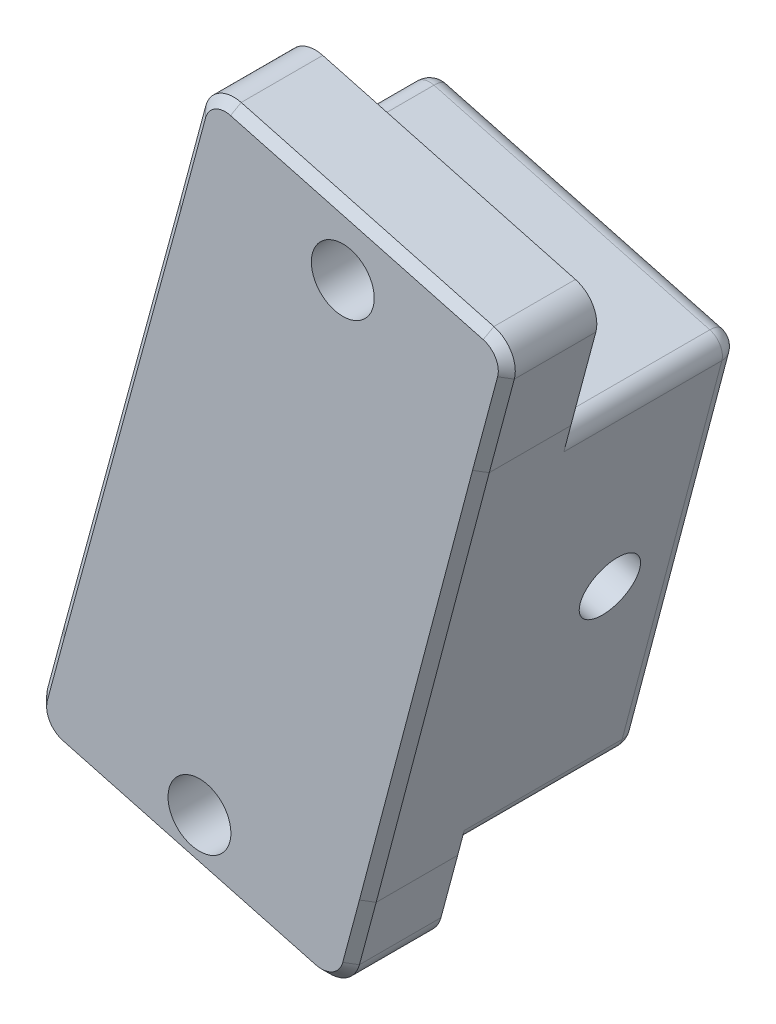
ISO-10303-21;
HEADER;
FILE_DESCRIPTION(('STEP AP214'),'2;1');
FILE_NAME('part.step','',(''),(''),'','','');
FILE_SCHEMA(('AUTOMOTIVE_DESIGN { 1 0 10303 214 1 1 1 1 }'));
ENDSEC;
DATA;
#1=APPLICATION_CONTEXT('core data for automotive mechanical design processes');
#2=APPLICATION_PROTOCOL_DEFINITION('international standard','automotive_design',2000,#1);
#3=PRODUCT_CONTEXT('',#1,'mechanical');
#4=PRODUCT('Part','Part','',(#3));
#5=PRODUCT_RELATED_PRODUCT_CATEGORY('part','',(#4));
#6=PRODUCT_DEFINITION_FORMATION('','',#4);
#7=PRODUCT_DEFINITION_CONTEXT('part definition',#1,'design');
#8=PRODUCT_DEFINITION('design','',#6,#7);
#9=PRODUCT_DEFINITION_SHAPE('','',#8);
#10=(LENGTH_UNIT() NAMED_UNIT(*) SI_UNIT(.MILLI.,.METRE.));
#11=(NAMED_UNIT(*) PLANE_ANGLE_UNIT() SI_UNIT($,.RADIAN.));
#12=(NAMED_UNIT(*) SI_UNIT($,.STERADIAN.) SOLID_ANGLE_UNIT());
#13=UNCERTAINTY_MEASURE_WITH_UNIT(LENGTH_MEASURE(1.E-05),#10,'distance_accuracy_value','');
#14=(GEOMETRIC_REPRESENTATION_CONTEXT(3) GLOBAL_UNCERTAINTY_ASSIGNED_CONTEXT((#13)) GLOBAL_UNIT_ASSIGNED_CONTEXT((#10,
#11,#12)) REPRESENTATION_CONTEXT('',''));
#15=CARTESIAN_POINT('',(0.,0.,0.));
#16=DIRECTION('',(0.,0.,1.));
#17=DIRECTION('',(1.,0.,0.));
#18=AXIS2_PLACEMENT_3D('',#15,#16,#17);
#19=CARTESIAN_POINT('',(63.1718953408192,-38.5433302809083,0.));
#20=DIRECTION('',(0.,0.,1.));
#21=DIRECTION('',(1.,0.,0.));
#22=AXIS2_PLACEMENT_3D('',#19,#20,#21);
#23=PLANE('',#22);
#24=CARTESIAN_POINT('',(59.1942618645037,-38.5128027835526,0.));
#25=DIRECTION('',(0.,0.,1.));
#26=DIRECTION('',(1.,0.,0.));
#27=AXIS2_PLACEMENT_3D('',#24,#25,#26);
#28=CIRCLE('',#27,0.925000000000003);
#29=CARTESIAN_POINT('',(60.1192618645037,-38.5128027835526,0.));
#30=VERTEX_POINT('',#29);
#31=EDGE_CURVE('E258',#30,#30,#28,.T.);
#32=ORIENTED_EDGE('',*,*,#31,.T.);
#33=EDGE_LOOP('',(#32));
#34=FACE_BOUND('',#33,.T.);
#35=DIRECTION('',(0.965925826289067,-0.258819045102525,0.));
#36=VECTOR('',#35,1.);
#37=CARTESIAN_POINT('',(63.1787625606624,-41.8062903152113,0.));
#38=LINE('',#37,#36);
#39=CARTESIAN_POINT('',(54.5779552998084,-39.5017109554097,0.));
#40=VERTEX_POINT('',#39);
#41=CARTESIAN_POINT('',(62.6976465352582,-41.6773756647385,0.));
#42=VERTEX_POINT('',#41);
#43=EDGE_CURVE('E312',#40,#42,#38,.T.);
#44=ORIENTED_EDGE('',*,*,#43,.F.);
#45=CARTESIAN_POINT('',(54.4485457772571,-39.9846738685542,0.));
#46=DIRECTION('',(0.,0.,1.));
#47=DIRECTION('',(1.,0.,0.));
#48=AXIS2_PLACEMENT_3D('',#45,#46,#47);
#49=CIRCLE('',#48,0.5);
#50=CARTESIAN_POINT('',(53.9660822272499,-39.8534148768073,0.));
#51=VERTEX_POINT('',#50);
#52=EDGE_CURVE('E431',#40,#51,#49,.T.);
#53=ORIENTED_EDGE('',*,*,#52,.T.);
#54=DIRECTION('',(-0.262517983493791,-0.96492710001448,0.));
#55=VECTOR('',#54,1.);
#56=CARTESIAN_POINT('',(50.749710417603,-51.6757071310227,0.));
#57=LINE('',#56,#55);
#58=CARTESIAN_POINT('',(54.1755952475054,-39.0833160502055,0.));
#59=VERTEX_POINT('',#58);
#60=EDGE_CURVE('E267',#59,#51,#57,.T.);
#61=ORIENTED_EDGE('',*,*,#60,.F.);
#62=DIRECTION('',(-0.258819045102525,-0.965925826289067,0.));
#63=VECTOR('',#62,1.);
#64=CARTESIAN_POINT('',(54.9132295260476,-36.3304274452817,0.));
#65=LINE('',#64,#63);
#66=CARTESIAN_POINT('',(54.9132295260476,-36.3304274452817,0.));
#67=VERTEX_POINT('',#66);
#68=EDGE_CURVE('E263',#67,#59,#65,.T.);
#69=ORIENTED_EDGE('',*,*,#68,.F.);
#70=CARTESIAN_POINT('',(55.7342664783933,-36.5504236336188,0.));
#71=DIRECTION('',(0.,0.,1.));
#72=DIRECTION('',(1.,0.,0.));
#73=AXIS2_PLACEMENT_3D('',#70,#71,#72);
#74=CIRCLE('',#73,0.85);
#75=CARTESIAN_POINT('',(55.9542626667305,-35.7293866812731,0.));
#76=VERTEX_POINT('',#75);
#77=EDGE_CURVE('E249',#76,#67,#74,.T.);
#78=ORIENTED_EDGE('',*,*,#77,.F.);
#79=DIRECTION('',(-0.965925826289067,0.258819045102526,0.));
#80=VECTOR('',#79,1.);
#81=CARTESIAN_POINT('',(63.3918915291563,-37.7222933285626,0.));
#82=LINE('',#81,#80);
#83=CARTESIAN_POINT('',(63.3918915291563,-37.7222933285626,0.));
#84=VERTEX_POINT('',#83);
#85=EDGE_CURVE('E234',#84,#76,#82,.T.);
#86=ORIENTED_EDGE('',*,*,#85,.F.);
#87=CARTESIAN_POINT('',(63.1718953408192,-38.5433302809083,0.));
#88=DIRECTION('',(0.,0.,1.));
#89=DIRECTION('',(1.,0.,0.));
#90=AXIS2_PLACEMENT_3D('',#87,#88,#89);
#91=CIRCLE('',#90,0.850000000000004);
#92=CARTESIAN_POINT('',(63.9929322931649,-38.7633264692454,0.));
#93=VERTEX_POINT('',#92);
#94=EDGE_CURVE('E246',#93,#84,#91,.T.);
#95=ORIENTED_EDGE('',*,*,#94,.F.);
#96=DIRECTION('',(0.258819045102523,0.965925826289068,0.));
#97=VECTOR('',#96,1.);
#98=CARTESIAN_POINT('',(63.2552980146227,-41.5162150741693,0.));
#99=LINE('',#98,#97);
#100=CARTESIAN_POINT('',(63.2552980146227,-41.5162150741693,0.));
#101=VERTEX_POINT('',#100);
#102=EDGE_CURVE('E286',#101,#93,#99,.T.);
#103=ORIENTED_EDGE('',*,*,#102,.F.);
#104=DIRECTION('',(0.255116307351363,0.96691037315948,0.));
#105=VECTOR('',#104,1.);
#106=CARTESIAN_POINT('',(63.2552980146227,-41.5162150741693,0.));
#107=LINE('',#106,#105);
#108=CARTESIAN_POINT('',(63.0516921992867,-42.2878967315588,0.));
#109=VERTEX_POINT('',#108);
#110=EDGE_CURVE('E60',#109,#101,#107,.T.);
#111=ORIENTED_EDGE('',*,*,#110,.F.);
#112=CARTESIAN_POINT('',(62.5682370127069,-42.1603385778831,0.));
#113=DIRECTION('',(0.,0.,1.));
#114=DIRECTION('',(1.,0.,0.));
#115=AXIS2_PLACEMENT_3D('',#112,#113,#114);
#116=CIRCLE('',#115,0.5);
#117=EDGE_CURVE('E434',#109,#42,#116,.T.);
#118=ORIENTED_EDGE('',*,*,#117,.T.);
#119=EDGE_LOOP('',(#44,#53,#61,#69,#78,#86,#95,#103,#111,#118));
#120=FACE_BOUND('',#119,.T.);
#121=ADVANCED_FACE('F43',(#34,#120),#23,.F.);
#122=CARTESIAN_POINT('',(54.9755114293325,-54.2573937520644,0.));
#123=DIRECTION('',(0.,0.,1.));
#124=DIRECTION('',(1.,0.,0.));
#125=AXIS2_PLACEMENT_3D('',#122,#123,#124);
#126=CIRCLE('',#125,0.925000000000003);
#127=CARTESIAN_POINT('',(55.9005114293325,-54.2573937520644,0.));
#128=VERTEX_POINT('',#127);
#129=EDGE_CURVE('E255',#128,#128,#126,.T.);
#130=ORIENTED_EDGE('',*,*,#129,.T.);
#131=EDGE_LOOP('',(#130));
#132=FACE_BOUND('',#131,.T.);
#133=DIRECTION('',(-0.965925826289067,0.258819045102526,0.));
#134=VECTOR('',#133,1.);
#135=CARTESIAN_POINT('',(59.9897853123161,-53.8927586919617,0.));
#136=LINE('',#135,#134);
#137=CARTESIAN_POINT('',(59.5049684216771,-53.762852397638,0.));
#138=VERTEX_POINT('',#137);
#139=CARTESIAN_POINT('',(51.3001572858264,-51.5643798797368,0.));
#140=VERTEX_POINT('',#139);
#141=EDGE_CURVE('E397',#138,#140,#136,.T.);
#142=ORIENTED_EDGE('',*,*,#141,.F.);
#143=CARTESIAN_POINT('',(59.6343779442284,-53.2798894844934,0.));
#144=DIRECTION('',(0.,0.,1.));
#145=DIRECTION('',(1.,0.,0.));
#146=AXIS2_PLACEMENT_3D('',#143,#144,#145);
#147=CIRCLE('',#146,0.5);
#148=CARTESIAN_POINT('',(60.1178331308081,-53.4074476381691,0.));
#149=VERTEX_POINT('',#148);
#150=EDGE_CURVE('E52',#138,#149,#147,.T.);
#151=ORIENTED_EDGE('',*,*,#150,.T.);
#152=CARTESIAN_POINT('',(59.9260057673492,-54.1344880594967,0.));
#153=VERTEX_POINT('',#152);
#154=EDGE_CURVE('E284',#153,#149,#107,.T.);
#155=ORIENTED_EDGE('',*,*,#154,.F.);
#156=DIRECTION('',(0.258819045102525,0.965925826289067,0.));
#157=VECTOR('',#156,1.);
#158=CARTESIAN_POINT('',(59.4342495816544,-55.9697471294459,0.));
#159=LINE('',#158,#157);
#160=CARTESIAN_POINT('',(59.4342495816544,-55.9697471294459,0.));
#161=VERTEX_POINT('',#160);
#162=EDGE_CURVE('E281',#161,#153,#159,.T.);
#163=ORIENTED_EDGE('',*,*,#162,.F.);
#164=CARTESIAN_POINT('',(58.5649163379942,-55.7368099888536,0.));
#165=DIRECTION('',(0.,0.,1.));
#166=DIRECTION('',(1.,0.,0.));
#167=AXIS2_PLACEMENT_3D('',#164,#165,#166);
#168=CIRCLE('',#167,0.9);
#169=CARTESIAN_POINT('',(58.3319791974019,-56.6061432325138,0.));
#170=VERTEX_POINT('',#169);
#171=EDGE_CURVE('E278',#170,#161,#168,.T.);
#172=ORIENTED_EDGE('',*,*,#171,.F.);
#173=DIRECTION('',(0.965925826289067,-0.258819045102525,0.));
#174=VECTOR('',#173,1.);
#175=CARTESIAN_POINT('',(50.8943503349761,-54.6132365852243,0.));
#176=LINE('',#175,#174);
#177=CARTESIAN_POINT('',(50.8943503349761,-54.6132365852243,0.));
#178=VERTEX_POINT('',#177);
#179=EDGE_CURVE('E275',#178,#170,#176,.T.);
#180=ORIENTED_EDGE('',*,*,#179,.F.);
#181=CARTESIAN_POINT('',(51.1272874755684,-53.7439033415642,0.));
#182=DIRECTION('',(0.,0.,1.));
#183=DIRECTION('',(1.,0.,0.));
#184=AXIS2_PLACEMENT_3D('',#181,#182,#183);
#185=CIRCLE('',#184,0.899999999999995);
#186=CARTESIAN_POINT('',(50.2579542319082,-53.5109662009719,0.));
#187=VERTEX_POINT('',#186);
#188=EDGE_CURVE('E272',#187,#178,#185,.T.);
#189=ORIENTED_EDGE('',*,*,#188,.F.);
#190=DIRECTION('',(-0.258819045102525,-0.965925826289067,0.));
#191=VECTOR('',#190,1.);
#192=CARTESIAN_POINT('',(50.749710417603,-51.6757071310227,0.));
#193=LINE('',#192,#191);
#194=CARTESIAN_POINT('',(50.749710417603,-51.6757071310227,0.));
#195=VERTEX_POINT('',#194);
#196=EDGE_CURVE('E269',#195,#187,#193,.T.);
#197=ORIENTED_EDGE('',*,*,#196,.F.);
#198=CARTESIAN_POINT('',(50.9471032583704,-50.9501579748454,0.));
#199=VERTEX_POINT('',#198);
#200=EDGE_CURVE('E266',#199,#195,#57,.T.);
#201=ORIENTED_EDGE('',*,*,#200,.F.);
#202=CARTESIAN_POINT('',(51.4295668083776,-51.0814169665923,0.));
#203=DIRECTION('',(0.,0.,1.));
#204=DIRECTION('',(1.,0.,0.));
#205=AXIS2_PLACEMENT_3D('',#202,#203,#204);
#206=CIRCLE('',#205,0.5);
#207=EDGE_CURVE('E11',#199,#140,#206,.T.);
#208=ORIENTED_EDGE('',*,*,#207,.T.);
#209=EDGE_LOOP('',(#142,#151,#155,#163,#172,#180,#189,#197,#201,#208));
#210=FACE_BOUND('',#209,.T.);
#211=ADVANCED_FACE('F506',(#132,#210),#23,.F.);
#212=CARTESIAN_POINT('',(54.9755114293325,-54.2573937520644,27.722364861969));
#213=DIRECTION('',(0.,0.,-1.));
#214=DIRECTION('',(-1.,0.,0.));
#215=AXIS2_PLACEMENT_3D('',#212,#213,#214);
#216=CYLINDRICAL_SURFACE('',#215,0.925000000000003);
#217=ORIENTED_EDGE('',*,*,#129,.F.);
#218=EDGE_LOOP('',(#217));
#219=FACE_BOUND('',#218,.T.);
#220=CARTESIAN_POINT('',(54.9755114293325,-54.2573937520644,2.64999999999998));
#221=DIRECTION('',(0.,0.,1.));
#222=DIRECTION('',(0.,-1.,0.));
#223=AXIS2_PLACEMENT_3D('',#220,#221,#222);
#224=CIRCLE('',#223,0.925000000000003);
#225=CARTESIAN_POINT('',(54.9755114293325,-55.1823937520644,2.64999999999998));
#226=VERTEX_POINT('',#225);
#227=EDGE_CURVE('E311',#226,#226,#224,.T.);
#228=ORIENTED_EDGE('',*,*,#227,.T.);
#229=EDGE_LOOP('',(#228));
#230=FACE_BOUND('',#229,.T.);
#231=ADVANCED_FACE('F533',(#219,#230),#216,.F.);
#232=CARTESIAN_POINT('',(63.2552980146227,-41.5162150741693,27.722364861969));
#233=DIRECTION('',(-0.965925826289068,0.258819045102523,0.));
#234=DIRECTION('',(-0.258819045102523,-0.965925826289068,0.));
#235=AXIS2_PLACEMENT_3D('',#232,#233,#234);
#236=PLANE('',#235);
#237=DIRECTION('',(0.,0.,-1.));
#238=VECTOR('',#237,1.);
#239=CARTESIAN_POINT('',(63.9929322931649,-38.7633264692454,27.722364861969));
#240=LINE('',#239,#238);
#241=CARTESIAN_POINT('',(63.9929322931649,-38.7633264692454,2.39999999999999));
#242=VERTEX_POINT('',#241);
#243=EDGE_CURVE('E253',#242,#93,#240,.T.);
#244=ORIENTED_EDGE('',*,*,#243,.F.);
#245=DIRECTION('',(-0.258819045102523,-0.965925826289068,0.));
#246=VECTOR('',#245,1.);
#247=CARTESIAN_POINT('',(63.2552980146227,-41.5162150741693,2.39999999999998));
#248=LINE('',#247,#246);
#249=CARTESIAN_POINT('',(63.2552980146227,-41.5162150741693,2.39999999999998));
#250=VERTEX_POINT('',#249);
#251=EDGE_CURVE('E342',#242,#250,#248,.T.);
#252=ORIENTED_EDGE('',*,*,#251,.T.);
#253=DIRECTION('',(0.,0.,-1.));
#254=VECTOR('',#253,1.);
#255=CARTESIAN_POINT('',(63.2552980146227,-41.5162150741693,27.722364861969));
#256=LINE('',#255,#254);
#257=EDGE_CURVE('E289',#250,#101,#256,.T.);
#258=ORIENTED_EDGE('',*,*,#257,.T.);
#259=ORIENTED_EDGE('',*,*,#102,.T.);
#260=EDGE_LOOP('',(#244,#252,#258,#259));
#261=FACE_BOUND('',#260,.T.);
#262=ADVANCED_FACE('F535',(#261),#236,.F.);
#263=CARTESIAN_POINT('',(63.2552980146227,-41.5162150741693,27.722364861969));
#264=DIRECTION('',(-0.96691037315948,0.255116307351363,0.));
#265=DIRECTION('',(-0.255116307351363,-0.96691037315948,0.));
#266=AXIS2_PLACEMENT_3D('',#263,#264,#265);
#267=PLANE('',#266);
#268=CARTESIAN_POINT('',(61.5810240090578,-47.8618419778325,-2.82500000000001));
#269=DIRECTION('',(0.96691037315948,-0.255116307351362,0.));
#270=DIRECTION('',(0.255116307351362,0.96691037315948,0.));
#271=AXIS2_PLACEMENT_3D('',#268,#269,#270);
#272=CIRCLE('',#271,0.875000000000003);
#273=CARTESIAN_POINT('',(61.8042507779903,-47.0157954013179,-2.82500000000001));
#274=VERTEX_POINT('',#273);
#275=EDGE_CURVE('E513',#274,#274,#272,.T.);
#276=ORIENTED_EDGE('',*,*,#275,.F.);
#277=EDGE_LOOP('',(#276));
#278=FACE_BOUND('',#277,.T.);
#279=DIRECTION('',(0.,0.,1.));
#280=VECTOR('',#279,1.);
#281=CARTESIAN_POINT('',(63.0516921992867,-42.2878967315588,27.722364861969));
#282=LINE('',#281,#280);
#283=CARTESIAN_POINT('',(63.0516921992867,-42.2878967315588,-4.65));
#284=VERTEX_POINT('',#283);
#285=EDGE_CURVE('E429',#284,#109,#282,.T.);
#286=ORIENTED_EDGE('',*,*,#285,.T.);
#287=ORIENTED_EDGE('',*,*,#110,.T.);
#288=ORIENTED_EDGE('',*,*,#257,.F.);
#289=DIRECTION('',(-0.255116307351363,-0.96691037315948,0.));
#290=VECTOR('',#289,1.);
#291=CARTESIAN_POINT('',(59.9260057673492,-54.1344880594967,2.39999999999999));
#292=LINE('',#291,#290);
#293=CARTESIAN_POINT('',(59.9260057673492,-54.1344880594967,2.39999999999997));
#294=VERTEX_POINT('',#293);
#295=EDGE_CURVE('E340',#250,#294,#292,.T.);
#296=ORIENTED_EDGE('',*,*,#295,.T.);
#297=DIRECTION('',(0.,0.,-1.));
#298=VECTOR('',#297,1.);
#299=CARTESIAN_POINT('',(59.9260057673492,-54.1344880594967,27.722364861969));
#300=LINE('',#299,#298);
#301=EDGE_CURVE('E291',#294,#153,#300,.T.);
#302=ORIENTED_EDGE('',*,*,#301,.T.);
#303=ORIENTED_EDGE('',*,*,#154,.T.);
#304=DIRECTION('',(0.,0.,1.));
#305=VECTOR('',#304,1.);
#306=CARTESIAN_POINT('',(60.1178331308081,-53.4074476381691,27.722364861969));
#307=LINE('',#306,#305);
#308=CARTESIAN_POINT('',(60.1178331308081,-53.4074476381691,-4.65));
#309=VERTEX_POINT('',#308);
#310=EDGE_CURVE('E426',#149,#309,#307,.F.);
#311=ORIENTED_EDGE('',*,*,#310,.T.);
#312=DIRECTION('',(-0.255116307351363,-0.96691037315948,0.));
#313=VECTOR('',#312,1.);
#314=CARTESIAN_POINT('',(63.2552980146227,-41.5162150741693,-4.65));
#315=LINE('',#314,#313);
#316=EDGE_CURVE('E67',#309,#284,#315,.F.);
#317=ORIENTED_EDGE('',*,*,#316,.T.);
#318=EDGE_LOOP('',(#286,#287,#288,#296,#302,#303,#311,#317));
#319=FACE_BOUND('',#318,.T.);
#320=ADVANCED_FACE('F542',(#278,#319),#267,.F.);
#321=CARTESIAN_POINT('',(59.4342495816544,-55.9697471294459,27.722364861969));
#322=DIRECTION('',(-0.965925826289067,0.258819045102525,0.));
#323=DIRECTION('',(-0.258819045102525,-0.965925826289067,0.));
#324=AXIS2_PLACEMENT_3D('',#321,#322,#323);
#325=PLANE('',#324);
#326=ORIENTED_EDGE('',*,*,#301,.F.);
#327=DIRECTION('',(-0.258819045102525,-0.965925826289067,0.));
#328=VECTOR('',#327,1.);
#329=CARTESIAN_POINT('',(59.4342495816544,-55.9697471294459,2.39999999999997));
#330=LINE('',#329,#328);
#331=CARTESIAN_POINT('',(59.4342495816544,-55.9697471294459,2.39999999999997));
#332=VERTEX_POINT('',#331);
#333=EDGE_CURVE('E353',#294,#332,#330,.T.);
#334=ORIENTED_EDGE('',*,*,#333,.T.);
#335=DIRECTION('',(0.,0.,-1.));
#336=VECTOR('',#335,1.);
#337=CARTESIAN_POINT('',(59.4342495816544,-55.9697471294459,27.722364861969));
#338=LINE('',#337,#336);
#339=EDGE_CURVE('E293',#332,#161,#338,.T.);
#340=ORIENTED_EDGE('',*,*,#339,.T.);
#341=ORIENTED_EDGE('',*,*,#162,.T.);
#342=EDGE_LOOP('',(#326,#334,#340,#341));
#343=FACE_BOUND('',#342,.T.);
#344=ADVANCED_FACE('F554',(#343),#325,.F.);
#345=CARTESIAN_POINT('',(58.5649163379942,-55.7368099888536,27.722364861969));
#346=DIRECTION('',(0.,0.,-1.));
#347=DIRECTION('',(-1.,0.,0.));
#348=AXIS2_PLACEMENT_3D('',#345,#346,#347);
#349=CYLINDRICAL_SURFACE('',#348,0.9);
#350=ORIENTED_EDGE('',*,*,#339,.F.);
#351=CARTESIAN_POINT('',(58.5649163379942,-55.7368099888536,2.39999999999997));
#352=DIRECTION('',(0.,0.,1.));
#353=DIRECTION('',(1.,0.,0.));
#354=AXIS2_PLACEMENT_3D('',#351,#352,#353);
#355=CIRCLE('',#354,0.9);
#356=CARTESIAN_POINT('',(58.3319791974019,-56.6061432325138,2.39999999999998));
#357=VERTEX_POINT('',#356);
#358=EDGE_CURVE('E357',#332,#357,#355,.F.);
#359=ORIENTED_EDGE('',*,*,#358,.T.);
#360=DIRECTION('',(0.,0.,-1.));
#361=VECTOR('',#360,1.);
#362=CARTESIAN_POINT('',(58.3319791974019,-56.6061432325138,27.722364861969));
#363=LINE('',#362,#361);
#364=EDGE_CURVE('E295',#357,#170,#363,.T.);
#365=ORIENTED_EDGE('',*,*,#364,.T.);
#366=ORIENTED_EDGE('',*,*,#171,.T.);
#367=EDGE_LOOP('',(#350,#359,#365,#366));
#368=FACE_BOUND('',#367,.T.);
#369=ADVANCED_FACE('F558',(#368),#349,.T.);
#370=CARTESIAN_POINT('',(50.8943503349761,-54.6132365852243,27.722364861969));
#371=DIRECTION('',(0.258819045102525,0.965925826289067,0.));
#372=DIRECTION('',(-0.965925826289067,0.258819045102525,0.));
#373=AXIS2_PLACEMENT_3D('',#370,#371,#372);
#374=PLANE('',#373);
#375=ORIENTED_EDGE('',*,*,#364,.F.);
#376=DIRECTION('',(-0.965925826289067,0.258819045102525,0.));
#377=VECTOR('',#376,1.);
#378=CARTESIAN_POINT('',(50.8943503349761,-54.6132365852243,2.39999999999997));
#379=LINE('',#378,#377);
#380=CARTESIAN_POINT('',(50.8943503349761,-54.6132365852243,2.39999999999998));
#381=VERTEX_POINT('',#380);
#382=EDGE_CURVE('E359',#357,#381,#379,.T.);
#383=ORIENTED_EDGE('',*,*,#382,.T.);
#384=DIRECTION('',(0.,0.,-1.));
#385=VECTOR('',#384,1.);
#386=CARTESIAN_POINT('',(50.8943503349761,-54.6132365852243,27.722364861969));
#387=LINE('',#386,#385);
#388=EDGE_CURVE('E297',#381,#178,#387,.T.);
#389=ORIENTED_EDGE('',*,*,#388,.T.);
#390=ORIENTED_EDGE('',*,*,#179,.T.);
#391=EDGE_LOOP('',(#375,#383,#389,#390));
#392=FACE_BOUND('',#391,.T.);
#393=ADVANCED_FACE('F562',(#392),#374,.F.);
#394=CARTESIAN_POINT('',(51.1272874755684,-53.7439033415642,27.722364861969));
#395=DIRECTION('',(0.,0.,-1.));
#396=DIRECTION('',(-1.,0.,0.));
#397=AXIS2_PLACEMENT_3D('',#394,#395,#396);
#398=CYLINDRICAL_SURFACE('',#397,0.899999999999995);
#399=ORIENTED_EDGE('',*,*,#388,.F.);
#400=CARTESIAN_POINT('',(51.1272874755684,-53.7439033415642,2.39999999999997));
#401=DIRECTION('',(0.,0.,1.));
#402=DIRECTION('',(1.,0.,0.));
#403=AXIS2_PLACEMENT_3D('',#400,#401,#402);
#404=CIRCLE('',#403,0.899999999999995);
#405=CARTESIAN_POINT('',(50.2579542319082,-53.5109662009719,2.39999999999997));
#406=VERTEX_POINT('',#405);
#407=EDGE_CURVE('E355',#381,#406,#404,.F.);
#408=ORIENTED_EDGE('',*,*,#407,.T.);
#409=DIRECTION('',(0.,0.,-1.));
#410=VECTOR('',#409,1.);
#411=CARTESIAN_POINT('',(50.2579542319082,-53.5109662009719,27.722364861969));
#412=LINE('',#411,#410);
#413=EDGE_CURVE('E299',#406,#187,#412,.T.);
#414=ORIENTED_EDGE('',*,*,#413,.T.);
#415=ORIENTED_EDGE('',*,*,#188,.T.);
#416=EDGE_LOOP('',(#399,#408,#414,#415));
#417=FACE_BOUND('',#416,.T.);
#418=ADVANCED_FACE('F566',(#417),#398,.T.);
#419=CARTESIAN_POINT('',(50.749710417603,-51.6757071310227,27.722364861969));
#420=DIRECTION('',(0.965925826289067,-0.258819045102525,0.));
#421=DIRECTION('',(0.258819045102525,0.965925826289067,0.));
#422=AXIS2_PLACEMENT_3D('',#419,#420,#421);
#423=PLANE('',#422);
#424=ORIENTED_EDGE('',*,*,#413,.F.);
#425=DIRECTION('',(0.258819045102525,0.965925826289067,0.));
#426=VECTOR('',#425,1.);
#427=CARTESIAN_POINT('',(50.749710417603,-51.6757071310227,2.39999999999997));
#428=LINE('',#427,#426);
#429=CARTESIAN_POINT('',(50.749710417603,-51.6757071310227,2.39999999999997));
#430=VERTEX_POINT('',#429);
#431=EDGE_CURVE('E351',#406,#430,#428,.T.);
#432=ORIENTED_EDGE('',*,*,#431,.T.);
#433=DIRECTION('',(0.,0.,-1.));
#434=VECTOR('',#433,1.);
#435=CARTESIAN_POINT('',(50.749710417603,-51.6757071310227,27.722364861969));
#436=LINE('',#435,#434);
#437=EDGE_CURVE('E301',#430,#195,#436,.T.);
#438=ORIENTED_EDGE('',*,*,#437,.T.);
#439=ORIENTED_EDGE('',*,*,#196,.T.);
#440=EDGE_LOOP('',(#424,#432,#438,#439));
#441=FACE_BOUND('',#440,.T.);
#442=ADVANCED_FACE('F570',(#441),#423,.F.);
#443=CARTESIAN_POINT('',(50.749710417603,-51.6757071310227,27.722364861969));
#444=DIRECTION('',(0.96492710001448,-0.262517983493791,0.));
#445=DIRECTION('',(0.262517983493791,0.96492710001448,0.));
#446=AXIS2_PLACEMENT_3D('',#443,#444,#445);
#447=PLANE('',#446);
#448=CARTESIAN_POINT('',(52.4432401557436,-45.4508660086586,-2.82500000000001));
#449=DIRECTION('',(0.96492710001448,-0.262517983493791,0.));
#450=DIRECTION('',(0.262517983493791,0.96492710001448,0.));
#451=AXIS2_PLACEMENT_3D('',#448,#449,#450);
#452=ELLIPSE('',#451,0.875025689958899,0.875000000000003);
#453=CARTESIAN_POINT('',(52.6729501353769,-44.6065300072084,-2.82500000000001));
#454=VERTEX_POINT('',#453);
#455=EDGE_CURVE('E47',#454,#454,#452,.T.);
#456=ORIENTED_EDGE('',*,*,#455,.T.);
#457=EDGE_LOOP('',(#456));
#458=FACE_BOUND('',#457,.T.);
#459=ORIENTED_EDGE('',*,*,#60,.T.);
#460=DIRECTION('',(0.,0.,1.));
#461=VECTOR('',#460,1.);
#462=CARTESIAN_POINT('',(53.9660822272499,-39.8534148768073,27.722364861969));
#463=LINE('',#462,#461);
#464=CARTESIAN_POINT('',(53.9660822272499,-39.8534148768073,-4.65));
#465=VERTEX_POINT('',#464);
#466=EDGE_CURVE('E418',#51,#465,#463,.F.);
#467=ORIENTED_EDGE('',*,*,#466,.T.);
#468=DIRECTION('',(0.262517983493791,0.96492710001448,0.));
#469=VECTOR('',#468,1.);
#470=CARTESIAN_POINT('',(50.749710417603,-51.6757071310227,-4.65));
#471=LINE('',#470,#469);
#472=CARTESIAN_POINT('',(50.9471032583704,-50.9501579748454,-4.65));
#473=VERTEX_POINT('',#472);
#474=EDGE_CURVE('E416',#465,#473,#471,.F.);
#475=ORIENTED_EDGE('',*,*,#474,.T.);
#476=DIRECTION('',(0.,0.,1.));
#477=VECTOR('',#476,1.);
#478=CARTESIAN_POINT('',(50.9471032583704,-50.9501579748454,27.722364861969));
#479=LINE('',#478,#477);
#480=EDGE_CURVE('E413',#473,#199,#479,.T.);
#481=ORIENTED_EDGE('',*,*,#480,.T.);
#482=ORIENTED_EDGE('',*,*,#200,.T.);
#483=ORIENTED_EDGE('',*,*,#437,.F.);
#484=DIRECTION('',(0.262517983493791,0.96492710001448,0.));
#485=VECTOR('',#484,1.);
#486=CARTESIAN_POINT('',(54.1755952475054,-39.0833160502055,2.39999999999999));
#487=LINE('',#486,#485);
#488=CARTESIAN_POINT('',(54.1755952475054,-39.0833160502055,2.39999999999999));
#489=VERTEX_POINT('',#488);
#490=EDGE_CURVE('E337',#430,#489,#487,.T.);
#491=ORIENTED_EDGE('',*,*,#490,.T.);
#492=DIRECTION('',(0.,0.,-1.));
#493=VECTOR('',#492,1.);
#494=CARTESIAN_POINT('',(54.1755952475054,-39.0833160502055,27.722364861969));
#495=LINE('',#494,#493);
#496=EDGE_CURVE('E303',#489,#59,#495,.T.);
#497=ORIENTED_EDGE('',*,*,#496,.T.);
#498=EDGE_LOOP('',(#459,#467,#475,#481,#482,#483,#491,#497));
#499=FACE_BOUND('',#498,.T.);
#500=ADVANCED_FACE('F574',(#458,#499),#447,.F.);
#501=CARTESIAN_POINT('',(54.9132295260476,-36.3304274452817,27.722364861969));
#502=DIRECTION('',(0.965925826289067,-0.258819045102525,0.));
#503=DIRECTION('',(0.258819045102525,0.965925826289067,0.));
#504=AXIS2_PLACEMENT_3D('',#501,#502,#503);
#505=PLANE('',#504);
#506=ORIENTED_EDGE('',*,*,#496,.F.);
#507=DIRECTION('',(0.258819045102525,0.965925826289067,0.));
#508=VECTOR('',#507,1.);
#509=CARTESIAN_POINT('',(54.9132295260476,-36.3304274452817,2.39999999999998));
#510=LINE('',#509,#508);
#511=CARTESIAN_POINT('',(54.9132295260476,-36.3304274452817,2.39999999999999));
#512=VERTEX_POINT('',#511);
#513=EDGE_CURVE('E344',#489,#512,#510,.T.);
#514=ORIENTED_EDGE('',*,*,#513,.T.);
#515=DIRECTION('',(0.,0.,-1.));
#516=VECTOR('',#515,1.);
#517=CARTESIAN_POINT('',(54.9132295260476,-36.3304274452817,27.722364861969));
#518=LINE('',#517,#516);
#519=EDGE_CURVE('E305',#512,#67,#518,.T.);
#520=ORIENTED_EDGE('',*,*,#519,.T.);
#521=ORIENTED_EDGE('',*,*,#68,.T.);
#522=EDGE_LOOP('',(#506,#514,#520,#521));
#523=FACE_BOUND('',#522,.T.);
#524=ADVANCED_FACE('F578',(#523),#505,.F.);
#525=CARTESIAN_POINT('',(55.7342664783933,-36.5504236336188,27.722364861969));
#526=DIRECTION('',(0.,0.,-1.));
#527=DIRECTION('',(-1.,0.,0.));
#528=AXIS2_PLACEMENT_3D('',#525,#526,#527);
#529=CYLINDRICAL_SURFACE('',#528,0.85);
#530=ORIENTED_EDGE('',*,*,#519,.F.);
#531=CARTESIAN_POINT('',(55.7342664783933,-36.5504236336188,2.39999999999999));
#532=DIRECTION('',(0.,0.,1.));
#533=DIRECTION('',(1.,0.,0.));
#534=AXIS2_PLACEMENT_3D('',#531,#532,#533);
#535=CIRCLE('',#534,0.85);
#536=CARTESIAN_POINT('',(55.9542626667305,-35.7293866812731,2.39999999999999));
#537=VERTEX_POINT('',#536);
#538=EDGE_CURVE('E348',#512,#537,#535,.F.);
#539=ORIENTED_EDGE('',*,*,#538,.T.);
#540=DIRECTION('',(0.,0.,-1.));
#541=VECTOR('',#540,1.);
#542=CARTESIAN_POINT('',(55.9542626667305,-35.7293866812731,27.722364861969));
#543=LINE('',#542,#541);
#544=EDGE_CURVE('E242',#537,#76,#543,.T.);
#545=ORIENTED_EDGE('',*,*,#544,.T.);
#546=ORIENTED_EDGE('',*,*,#77,.T.);
#547=EDGE_LOOP('',(#530,#539,#545,#546));
#548=FACE_BOUND('',#547,.T.);
#549=ADVANCED_FACE('F582',(#548),#529,.T.);
#550=CARTESIAN_POINT('',(63.3918915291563,-37.7222933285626,27.722364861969));
#551=DIRECTION('',(-0.258819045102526,-0.965925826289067,0.));
#552=DIRECTION('',(0.965925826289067,-0.258819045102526,0.));
#553=AXIS2_PLACEMENT_3D('',#550,#551,#552);
#554=PLANE('',#553);
#555=ORIENTED_EDGE('',*,*,#544,.F.);
#556=DIRECTION('',(0.965925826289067,-0.258819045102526,0.));
#557=VECTOR('',#556,1.);
#558=CARTESIAN_POINT('',(63.3918915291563,-37.7222933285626,2.39999999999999));
#559=LINE('',#558,#557);
#560=CARTESIAN_POINT('',(63.3918915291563,-37.7222933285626,2.39999999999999));
#561=VERTEX_POINT('',#560);
#562=EDGE_CURVE('E237',#537,#561,#559,.T.);
#563=ORIENTED_EDGE('',*,*,#562,.T.);
#564=DIRECTION('',(0.,0.,-1.));
#565=VECTOR('',#564,1.);
#566=CARTESIAN_POINT('',(63.3918915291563,-37.7222933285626,27.722364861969));
#567=LINE('',#566,#565);
#568=EDGE_CURVE('E230',#561,#84,#567,.T.);
#569=ORIENTED_EDGE('',*,*,#568,.T.);
#570=ORIENTED_EDGE('',*,*,#85,.T.);
#571=EDGE_LOOP('',(#555,#563,#569,#570));
#572=FACE_BOUND('',#571,.T.);
#573=ADVANCED_FACE('F233',(#572),#554,.F.);
#574=CARTESIAN_POINT('',(63.1718953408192,-38.5433302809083,27.722364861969));
#575=DIRECTION('',(0.,0.,-1.));
#576=DIRECTION('',(-1.,0.,0.));
#577=AXIS2_PLACEMENT_3D('',#574,#575,#576);
#578=CYLINDRICAL_SURFACE('',#577,0.850000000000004);
#579=ORIENTED_EDGE('',*,*,#568,.F.);
#580=CARTESIAN_POINT('',(63.1718953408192,-38.5433302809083,2.39999999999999));
#581=DIRECTION('',(0.,0.,1.));
#582=DIRECTION('',(1.,0.,0.));
#583=AXIS2_PLACEMENT_3D('',#580,#581,#582);
#584=CIRCLE('',#583,0.850000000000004);
#585=EDGE_CURVE('E346',#561,#242,#584,.F.);
#586=ORIENTED_EDGE('',*,*,#585,.T.);
#587=ORIENTED_EDGE('',*,*,#243,.T.);
#588=ORIENTED_EDGE('',*,*,#94,.T.);
#589=EDGE_LOOP('',(#579,#586,#587,#588));
#590=FACE_BOUND('',#589,.T.);
#591=ADVANCED_FACE('F251',(#590),#578,.T.);
#592=CARTESIAN_POINT('',(59.1942618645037,-38.5128027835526,27.722364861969));
#593=DIRECTION('',(0.,0.,-1.));
#594=DIRECTION('',(-1.,0.,0.));
#595=AXIS2_PLACEMENT_3D('',#592,#593,#594);
#596=CYLINDRICAL_SURFACE('',#595,0.925000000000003);
#597=ORIENTED_EDGE('',*,*,#31,.F.);
#598=EDGE_LOOP('',(#597));
#599=FACE_BOUND('',#598,.T.);
#600=CARTESIAN_POINT('',(59.1942618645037,-38.5128027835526,2.64999999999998));
#601=DIRECTION('',(0.,0.,1.));
#602=DIRECTION('',(0.,-1.,0.));
#603=AXIS2_PLACEMENT_3D('',#600,#601,#602);
#604=CIRCLE('',#603,0.925000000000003);
#605=CARTESIAN_POINT('',(59.1942618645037,-39.4378027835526,2.64999999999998));
#606=VERTEX_POINT('',#605);
#607=EDGE_CURVE('E308',#606,#606,#604,.T.);
#608=ORIENTED_EDGE('',*,*,#607,.T.);
#609=EDGE_LOOP('',(#608));
#610=FACE_BOUND('',#609,.T.);
#611=ADVANCED_FACE('F520',(#599,#610),#596,.F.);
#612=CARTESIAN_POINT('',(0.,0.,2.64999999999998));
#613=DIRECTION('',(0.,0.,1.));
#614=DIRECTION('',(0.,1.,0.));
#615=AXIS2_PLACEMENT_3D('',#612,#613,#614);
#616=PLANE('',#615);
#617=CARTESIAN_POINT('',(63.1718953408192,-38.5433302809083,2.64999999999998));
#618=DIRECTION('',(0.,0.,1.));
#619=DIRECTION('',(0.,-1.,0.));
#620=AXIS2_PLACEMENT_3D('',#617,#618,#619);
#621=CIRCLE('',#620,0.600000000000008);
#622=CARTESIAN_POINT('',(63.7514508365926,-38.6986217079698,2.64999999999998));
#623=VERTEX_POINT('',#622);
#624=CARTESIAN_POINT('',(63.3271867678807,-37.9637747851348,2.64999999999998));
#625=VERTEX_POINT('',#624);
#626=EDGE_CURVE('E333',#623,#625,#621,.T.);
#627=ORIENTED_EDGE('',*,*,#626,.T.);
#628=DIRECTION('',(-0.965925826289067,0.258819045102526,0.));
#629=VECTOR('',#628,1.);
#630=CARTESIAN_POINT('',(55.8895579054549,-35.9708681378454,2.64999999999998));
#631=LINE('',#630,#629);
#632=CARTESIAN_POINT('',(55.8895579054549,-35.9708681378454,2.64999999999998));
#633=VERTEX_POINT('',#632);
#634=EDGE_CURVE('E335',#625,#633,#631,.T.);
#635=ORIENTED_EDGE('',*,*,#634,.T.);
#636=CARTESIAN_POINT('',(55.7342664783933,-36.5504236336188,2.64999999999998));
#637=DIRECTION('',(0.,0.,1.));
#638=DIRECTION('',(0.,-1.,0.));
#639=AXIS2_PLACEMENT_3D('',#636,#637,#638);
#640=CIRCLE('',#639,0.600000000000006);
#641=CARTESIAN_POINT('',(55.1547109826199,-36.3951322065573,2.64999999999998));
#642=VERTEX_POINT('',#641);
#643=EDGE_CURVE('E331',#633,#642,#640,.T.);
#644=ORIENTED_EDGE('',*,*,#643,.T.);
#645=DIRECTION('',(-0.258819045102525,-0.965925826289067,0.));
#646=VECTOR('',#645,1.);
#647=CARTESIAN_POINT('',(54.4170767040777,-39.1480208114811,2.64999999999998));
#648=LINE('',#647,#646);
#649=CARTESIAN_POINT('',(54.4170784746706,-39.1480212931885,2.64999999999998));
#650=VERTEX_POINT('',#649);
#651=EDGE_CURVE('E327',#642,#650,#648,.T.);
#652=ORIENTED_EDGE('',*,*,#651,.T.);
#653=DIRECTION('',(-0.262517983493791,-0.96492710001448,0.));
#654=VECTOR('',#653,1.);
#655=CARTESIAN_POINT('',(50.9909421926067,-51.7413366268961,2.64999999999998));
#656=LINE('',#655,#654);
#657=CARTESIAN_POINT('',(50.9911918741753,-51.7404118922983,2.64999999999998));
#658=VERTEX_POINT('',#657);
#659=EDGE_CURVE('E324',#650,#658,#656,.T.);
#660=ORIENTED_EDGE('',*,*,#659,.T.);
#661=DIRECTION('',(-0.258819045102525,-0.965925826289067,0.));
#662=VECTOR('',#661,1.);
#663=CARTESIAN_POINT('',(50.4994356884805,-53.5756709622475,2.64999999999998));
#664=LINE('',#663,#662);
#665=CARTESIAN_POINT('',(50.4994356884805,-53.5756709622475,2.64999999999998));
#666=VERTEX_POINT('',#665);
#667=EDGE_CURVE('E320',#658,#666,#664,.T.);
#668=ORIENTED_EDGE('',*,*,#667,.T.);
#669=CARTESIAN_POINT('',(51.1272874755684,-53.7439033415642,2.64999999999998));
#670=DIRECTION('',(0.,0.,1.));
#671=DIRECTION('',(0.,-1.,0.));
#672=AXIS2_PLACEMENT_3D('',#669,#670,#671);
#673=CIRCLE('',#672,0.649999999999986);
#674=CARTESIAN_POINT('',(50.9590550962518,-54.371755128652,2.64999999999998));
#675=VERTEX_POINT('',#674);
#676=EDGE_CURVE('E316',#666,#675,#673,.T.);
#677=ORIENTED_EDGE('',*,*,#676,.T.);
#678=DIRECTION('',(0.965925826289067,-0.258819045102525,0.));
#679=VECTOR('',#678,1.);
#680=CARTESIAN_POINT('',(58.3966839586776,-56.3646617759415,2.64999999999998));
#681=LINE('',#680,#679);
#682=CARTESIAN_POINT('',(58.3966839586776,-56.3646617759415,2.64999999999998));
#683=VERTEX_POINT('',#682);
#684=EDGE_CURVE('E241',#675,#683,#681,.T.);
#685=ORIENTED_EDGE('',*,*,#684,.T.);
#686=CARTESIAN_POINT('',(58.5649163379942,-55.7368099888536,2.64999999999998));
#687=DIRECTION('',(0.,0.,1.));
#688=DIRECTION('',(0.,-1.,0.));
#689=AXIS2_PLACEMENT_3D('',#686,#687,#688);
#690=CIRCLE('',#689,0.649999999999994);
#691=CARTESIAN_POINT('',(59.1927681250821,-55.9050423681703,2.64999999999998));
#692=VERTEX_POINT('',#691);
#693=EDGE_CURVE('E314',#683,#692,#690,.T.);
#694=ORIENTED_EDGE('',*,*,#693,.T.);
#695=DIRECTION('',(0.258819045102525,0.965925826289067,0.));
#696=VECTOR('',#695,1.);
#697=CARTESIAN_POINT('',(59.6845243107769,-54.069783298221,2.64999999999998));
#698=LINE('',#697,#696);
#699=CARTESIAN_POINT('',(59.6845243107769,-54.0697832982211,2.64999999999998));
#700=VERTEX_POINT('',#699);
#701=EDGE_CURVE('E318',#692,#700,#698,.T.);
#702=ORIENTED_EDGE('',*,*,#701,.T.);
#703=DIRECTION('',(0.255116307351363,0.96691037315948,0.));
#704=VECTOR('',#703,1.);
#705=CARTESIAN_POINT('',(63.0135704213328,-41.4524359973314,2.64999999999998));
#706=LINE('',#705,#704);
#707=CARTESIAN_POINT('',(63.0138147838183,-41.451509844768,2.64999999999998));
#708=VERTEX_POINT('',#707);
#709=EDGE_CURVE('E322',#700,#708,#706,.T.);
#710=ORIENTED_EDGE('',*,*,#709,.T.);
#711=DIRECTION('',(0.258819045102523,0.965925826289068,0.));
#712=VECTOR('',#711,1.);
#713=CARTESIAN_POINT('',(63.7514508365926,-38.6986217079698,2.64999999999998));
#714=LINE('',#713,#712);
#715=EDGE_CURVE('E329',#708,#623,#714,.T.);
#716=ORIENTED_EDGE('',*,*,#715,.T.);
#717=EDGE_LOOP('',(#627,#635,#644,#652,#660,#668,#677,#685,#694,#702,#710,#716));
#718=FACE_BOUND('',#717,.T.);
#719=ORIENTED_EDGE('',*,*,#607,.F.);
#720=EDGE_LOOP('',(#719));
#721=FACE_BOUND('',#720,.T.);
#722=ORIENTED_EDGE('',*,*,#227,.F.);
#723=EDGE_LOOP('',(#722));
#724=FACE_BOUND('',#723,.T.);
#725=ADVANCED_FACE('F523',(#718,#721,#724),#616,.T.);
#726=CARTESIAN_POINT('',(59.9897853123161,-53.8927586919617,-5.15));
#727=DIRECTION('',(0.258819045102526,0.965925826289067,0.));
#728=DIRECTION('',(-0.965925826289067,0.258819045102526,0.));
#729=AXIS2_PLACEMENT_3D('',#726,#727,#728);
#730=PLANE('',#729);
#731=DIRECTION('',(-0.965925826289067,0.258819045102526,0.));
#732=VECTOR('',#731,1.);
#733=CARTESIAN_POINT('',(59.9897853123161,-53.8927586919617,-4.65));
#734=LINE('',#733,#732);
#735=CARTESIAN_POINT('',(51.3001572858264,-51.5643798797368,-4.65));
#736=VERTEX_POINT('',#735);
#737=CARTESIAN_POINT('',(59.5049684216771,-53.762852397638,-4.65));
#738=VERTEX_POINT('',#737);
#739=EDGE_CURVE('E422',#736,#738,#734,.F.);
#740=ORIENTED_EDGE('',*,*,#739,.T.);
#741=DIRECTION('',(0.,0.,1.));
#742=VECTOR('',#741,1.);
#743=CARTESIAN_POINT('',(59.5049684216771,-53.762852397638,-5.15));
#744=LINE('',#743,#742);
#745=EDGE_CURVE('E424',#738,#138,#744,.T.);
#746=ORIENTED_EDGE('',*,*,#745,.T.);
#747=ORIENTED_EDGE('',*,*,#141,.T.);
#748=DIRECTION('',(0.,0.,1.));
#749=VECTOR('',#748,1.);
#750=CARTESIAN_POINT('',(51.3001572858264,-51.5643798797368,-5.15));
#751=LINE('',#750,#749);
#752=EDGE_CURVE('E420',#140,#736,#751,.F.);
#753=ORIENTED_EDGE('',*,*,#752,.T.);
#754=EDGE_LOOP('',(#740,#746,#747,#753));
#755=FACE_BOUND('',#754,.T.);
#756=ADVANCED_FACE('F495',(#755),#730,.F.);
#757=CARTESIAN_POINT('',(63.1787625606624,-41.8062903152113,-5.15));
#758=DIRECTION('',(-0.258819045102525,-0.965925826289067,0.));
#759=DIRECTION('',(0.965925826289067,-0.258819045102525,0.));
#760=AXIS2_PLACEMENT_3D('',#757,#758,#759);
#761=PLANE('',#760);
#762=DIRECTION('',(0.965925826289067,-0.258819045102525,0.));
#763=VECTOR('',#762,1.);
#764=CARTESIAN_POINT('',(63.1787625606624,-41.8062903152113,-4.65));
#765=LINE('',#764,#763);
#766=CARTESIAN_POINT('',(62.6976465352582,-41.6773756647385,-4.65));
#767=VERTEX_POINT('',#766);
#768=CARTESIAN_POINT('',(54.5779552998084,-39.5017109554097,-4.65));
#769=VERTEX_POINT('',#768);
#770=EDGE_CURVE('E408',#767,#769,#765,.F.);
#771=ORIENTED_EDGE('',*,*,#770,.T.);
#772=DIRECTION('',(0.,0.,1.));
#773=VECTOR('',#772,1.);
#774=CARTESIAN_POINT('',(54.5779552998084,-39.5017109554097,-5.15));
#775=LINE('',#774,#773);
#776=EDGE_CURVE('E411',#769,#40,#775,.T.);
#777=ORIENTED_EDGE('',*,*,#776,.T.);
#778=ORIENTED_EDGE('',*,*,#43,.T.);
#779=DIRECTION('',(0.,0.,1.));
#780=VECTOR('',#779,1.);
#781=CARTESIAN_POINT('',(62.6976465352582,-41.6773756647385,-5.15));
#782=LINE('',#781,#780);
#783=EDGE_CURVE('E406',#42,#767,#782,.F.);
#784=ORIENTED_EDGE('',*,*,#783,.T.);
#785=EDGE_LOOP('',(#771,#777,#778,#784));
#786=FACE_BOUND('',#785,.T.);
#787=ADVANCED_FACE('F772',(#786),#761,.F.);
#788=CARTESIAN_POINT('',(0.,0.,-5.15));
#789=DIRECTION('',(0.,0.,1.));
#790=DIRECTION('',(1.,0.,0.));
#791=AXIS2_PLACEMENT_3D('',#788,#789,#790);
#792=PLANE('',#791);
#793=DIRECTION('',(0.262517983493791,0.96492710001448,0.));
#794=VECTOR('',#793,1.);
#795=CARTESIAN_POINT('',(60.8247329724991,-16.5479715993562,-5.15));
#796=LINE('',#795,#794);
#797=CARTESIAN_POINT('',(51.4295668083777,-51.0814169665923,-5.15));
#798=VERTEX_POINT('',#797);
#799=CARTESIAN_POINT('',(54.4485457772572,-39.9846738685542,-5.15));
#800=VERTEX_POINT('',#799);
#801=EDGE_CURVE('E401',#798,#800,#796,.T.);
#802=ORIENTED_EDGE('',*,*,#801,.T.);
#803=DIRECTION('',(0.965925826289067,-0.258819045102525,0.));
#804=VECTOR('',#803,1.);
#805=CARTESIAN_POINT('',(-6.34880749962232,-23.6940721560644,-5.15));
#806=LINE('',#805,#804);
#807=CARTESIAN_POINT('',(62.5682370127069,-42.1603385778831,-5.15));
#808=VERTEX_POINT('',#807);
#809=EDGE_CURVE('E403',#800,#808,#806,.T.);
#810=ORIENTED_EDGE('',*,*,#809,.T.);
#811=DIRECTION('',(-0.255116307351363,-0.96691037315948,0.));
#812=VECTOR('',#811,1.);
#813=CARTESIAN_POINT('',(68.8959100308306,-18.1779724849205,-5.15));
#814=LINE('',#813,#812);
#815=CARTESIAN_POINT('',(59.6343779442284,-53.2798894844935,-5.15));
#816=VERTEX_POINT('',#815);
#817=EDGE_CURVE('E361',#808,#816,#814,.T.);
#818=ORIENTED_EDGE('',*,*,#817,.T.);
#819=DIRECTION('',(-0.965925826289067,0.258819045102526,0.));
#820=VECTOR('',#819,1.);
#821=CARTESIAN_POINT('',(-9.32522651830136,-34.8022191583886,-5.15));
#822=LINE('',#821,#820);
#823=EDGE_CURVE('E399',#816,#798,#822,.T.);
#824=ORIENTED_EDGE('',*,*,#823,.T.);
#825=EDGE_LOOP('',(#802,#810,#818,#824));
#826=FACE_BOUND('',#825,.T.);
#827=ADVANCED_FACE('F485',(#826),#792,.F.);
#828=CARTESIAN_POINT('',(69.1376376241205,-18.2417515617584,2.64999999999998));
#829=DIRECTION('',(0.683708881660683,-0.18039447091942,0.707106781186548));
#830=DIRECTION('',(-0.255116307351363,-0.96691037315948,0.));
#831=AXIS2_PLACEMENT_3D('',#828,#829,#830);
#832=PLANE('',#831);
#833=DIRECTION('',(-0.683015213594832,0.183013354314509,0.707104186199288));
#834=VECTOR('',#833,1.);
#835=CARTESIAN_POINT('',(59.9260057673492,-54.1344880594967,2.39999999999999));
#836=LINE('',#835,#834);
#837=EDGE_CURVE('E391',#294,#700,#836,.T.);
#838=ORIENTED_EDGE('',*,*,#837,.F.);
#839=ORIENTED_EDGE('',*,*,#295,.F.);
#840=DIRECTION('',(0.683015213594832,-0.183013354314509,-0.707104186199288));
#841=VECTOR('',#840,1.);
#842=CARTESIAN_POINT('',(63.0138147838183,-41.451509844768,2.64999999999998));
#843=LINE('',#842,#841);
#844=EDGE_CURVE('E394',#708,#250,#843,.T.);
#845=ORIENTED_EDGE('',*,*,#844,.F.);
#846=ORIENTED_EDGE('',*,*,#709,.F.);
#847=EDGE_LOOP('',(#838,#839,#845,#846));
#848=FACE_BOUND('',#847,.T.);
#849=ADVANCED_FACE('F668',(#848),#832,.T.);
#850=CARTESIAN_POINT('',(69.1555688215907,-18.5301788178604,2.64999999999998));
#851=DIRECTION('',(0.683012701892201,-0.183012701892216,0.707106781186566));
#852=DIRECTION('',(-0.258819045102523,-0.965925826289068,0.));
#853=AXIS2_PLACEMENT_3D('',#850,#851,#852);
#854=PLANE('',#853);
#855=ORIENTED_EDGE('',*,*,#844,.T.);
#856=ORIENTED_EDGE('',*,*,#251,.F.);
#857=DIRECTION('',(0.683012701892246,-0.183012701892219,-0.707106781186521));
#858=VECTOR('',#857,1.);
#859=CARTESIAN_POINT('',(63.7514508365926,-38.6986217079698,2.64999999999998));
#860=LINE('',#859,#858);
#861=EDGE_CURVE('E388',#623,#242,#860,.T.);
#862=ORIENTED_EDGE('',*,*,#861,.F.);
#863=ORIENTED_EDGE('',*,*,#715,.F.);
#864=EDGE_LOOP('',(#855,#856,#862,#863));
#865=FACE_BOUND('',#864,.T.);
#866=ADVANCED_FACE('F661',(#865),#854,.T.);
#867=CARTESIAN_POINT('',(69.2038651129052,-18.5431197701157,2.64999999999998));
#868=DIRECTION('',(0.683012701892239,-0.183012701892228,0.707106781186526));
#869=DIRECTION('',(-0.258819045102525,-0.965925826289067,0.));
#870=AXIS2_PLACEMENT_3D('',#867,#868,#869);
#871=PLANE('',#870);
#872=ORIENTED_EDGE('',*,*,#837,.T.);
#873=ORIENTED_EDGE('',*,*,#701,.F.);
#874=DIRECTION('',(-0.6830127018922,0.183012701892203,0.70710678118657));
#875=VECTOR('',#874,1.);
#876=CARTESIAN_POINT('',(59.4342495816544,-55.9697471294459,2.39999999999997));
#877=LINE('',#876,#875);
#878=EDGE_CURVE('E385',#332,#692,#877,.T.);
#879=ORIENTED_EDGE('',*,*,#878,.F.);
#880=ORIENTED_EDGE('',*,*,#333,.F.);
#881=EDGE_LOOP('',(#872,#873,#879,#880));
#882=FACE_BOUND('',#881,.T.);
#883=ADVANCED_FACE('F654',(#882),#871,.T.);
#884=CARTESIAN_POINT('',(63.1718953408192,-38.5433302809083,2.64999999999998));
#885=DIRECTION('',(0.,0.,-1.));
#886=DIRECTION('',(-1.,0.,0.));
#887=AXIS2_PLACEMENT_3D('',#884,#885,#886);
#888=CONICAL_SURFACE('',#887,0.600000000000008,0.785398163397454);
#889=ORIENTED_EDGE('',*,*,#861,.T.);
#890=ORIENTED_EDGE('',*,*,#585,.F.);
#891=DIRECTION('',(0.183012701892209,0.683012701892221,-0.707106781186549));
#892=VECTOR('',#891,1.);
#893=CARTESIAN_POINT('',(63.3271867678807,-37.9637747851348,2.64999999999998));
#894=LINE('',#893,#892);
#895=EDGE_CURVE('E382',#625,#561,#894,.T.);
#896=ORIENTED_EDGE('',*,*,#895,.F.);
#897=ORIENTED_EDGE('',*,*,#626,.F.);
#898=EDGE_LOOP('',(#889,#890,#896,#897));
#899=FACE_BOUND('',#898,.T.);
#900=ADVANCED_FACE('F647',(#899),#888,.T.);
#901=CARTESIAN_POINT('',(58.5649163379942,-55.7368099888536,2.64999999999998));
#902=DIRECTION('',(0.,0.,-1.));
#903=DIRECTION('',(-1.,0.,0.));
#904=AXIS2_PLACEMENT_3D('',#901,#902,#903);
#905=CONICAL_SURFACE('',#904,0.649999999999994,0.785398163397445);
#906=ORIENTED_EDGE('',*,*,#878,.T.);
#907=ORIENTED_EDGE('',*,*,#693,.F.);
#908=DIRECTION('',(0.183012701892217,0.68301270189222,0.707106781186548));
#909=VECTOR('',#908,1.);
#910=CARTESIAN_POINT('',(58.3319791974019,-56.6061432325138,2.39999999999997));
#911=LINE('',#910,#909);
#912=EDGE_CURVE('E379',#357,#683,#911,.T.);
#913=ORIENTED_EDGE('',*,*,#912,.F.);
#914=ORIENTED_EDGE('',*,*,#358,.F.);
#915=EDGE_LOOP('',(#906,#907,#913,#914));
#916=FACE_BOUND('',#915,.T.);
#917=ADVANCED_FACE('F640',(#916),#905,.T.);
#918=CARTESIAN_POINT('',(-5.24882655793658,-19.5888873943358,2.64999999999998));
#919=DIRECTION('',(0.183012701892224,0.683012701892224,0.707106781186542));
#920=DIRECTION('',(0.965925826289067,-0.258819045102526,0.));
#921=AXIS2_PLACEMENT_3D('',#918,#919,#920);
#922=PLANE('',#921);
#923=ORIENTED_EDGE('',*,*,#895,.T.);
#924=ORIENTED_EDGE('',*,*,#562,.F.);
#925=DIRECTION('',(0.183012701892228,0.683012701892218,-0.707106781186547));
#926=VECTOR('',#925,1.);
#927=CARTESIAN_POINT('',(55.8895579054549,-35.9708681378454,2.64999999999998));
#928=LINE('',#927,#926);
#929=EDGE_CURVE('E376',#633,#537,#928,.T.);
#930=ORIENTED_EDGE('',*,*,#929,.F.);
#931=ORIENTED_EDGE('',*,*,#634,.F.);
#932=EDGE_LOOP('',(#923,#924,#930,#931));
#933=FACE_BOUND('',#932,.T.);
#934=ADVANCED_FACE('F633',(#933),#922,.T.);
#935=CARTESIAN_POINT('',(-10.1793293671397,-37.9897743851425,2.64999999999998));
#936=DIRECTION('',(-0.18301270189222,-0.68301270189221,0.707106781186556));
#937=DIRECTION('',(-0.965925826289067,0.258819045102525,0.));
#938=AXIS2_PLACEMENT_3D('',#935,#936,#937);
#939=PLANE('',#938);
#940=ORIENTED_EDGE('',*,*,#912,.T.);
#941=ORIENTED_EDGE('',*,*,#684,.F.);
#942=DIRECTION('',(0.183012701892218,0.683012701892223,0.707106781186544));
#943=VECTOR('',#942,1.);
#944=CARTESIAN_POINT('',(50.8943503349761,-54.6132365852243,2.39999999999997));
#945=LINE('',#944,#943);
#946=EDGE_CURVE('E373',#381,#675,#945,.T.);
#947=ORIENTED_EDGE('',*,*,#946,.F.);
#948=ORIENTED_EDGE('',*,*,#382,.F.);
#949=EDGE_LOOP('',(#940,#941,#947,#948));
#950=FACE_BOUND('',#949,.T.);
#951=ADVANCED_FACE('F626',(#950),#939,.T.);
#952=CARTESIAN_POINT('',(55.7342664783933,-36.5504236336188,2.64999999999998));
#953=DIRECTION('',(0.,0.,-1.));
#954=DIRECTION('',(-1.,0.,0.));
#955=AXIS2_PLACEMENT_3D('',#952,#953,#954);
#956=CONICAL_SURFACE('',#955,0.600000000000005,0.785398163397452);
#957=ORIENTED_EDGE('',*,*,#929,.T.);
#958=ORIENTED_EDGE('',*,*,#538,.F.);
#959=DIRECTION('',(-0.683012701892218,0.183012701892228,-0.707106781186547));
#960=VECTOR('',#959,1.);
#961=CARTESIAN_POINT('',(55.1547109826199,-36.3951322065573,2.64999999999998));
#962=LINE('',#961,#960);
#963=EDGE_CURVE('E370',#642,#512,#962,.T.);
#964=ORIENTED_EDGE('',*,*,#963,.F.);
#965=ORIENTED_EDGE('',*,*,#643,.F.);
#966=EDGE_LOOP('',(#957,#958,#964,#965));
#967=FACE_BOUND('',#966,.T.);
#968=ADVANCED_FACE('F619',(#967),#956,.T.);
#969=CARTESIAN_POINT('',(51.1272874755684,-53.7439033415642,2.64999999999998));
#970=DIRECTION('',(0.,0.,-1.));
#971=DIRECTION('',(-1.,0.,0.));
#972=AXIS2_PLACEMENT_3D('',#969,#970,#971);
#973=CONICAL_SURFACE('',#972,0.649999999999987,0.78539816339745);
#974=ORIENTED_EDGE('',*,*,#946,.T.);
#975=ORIENTED_EDGE('',*,*,#676,.F.);
#976=DIRECTION('',(0.68301270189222,-0.183012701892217,0.707106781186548));
#977=VECTOR('',#976,1.);
#978=CARTESIAN_POINT('',(50.2579542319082,-53.5109662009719,2.39999999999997));
#979=LINE('',#978,#977);
#980=EDGE_CURVE('E367',#406,#666,#979,.T.);
#981=ORIENTED_EDGE('',*,*,#980,.F.);
#982=ORIENTED_EDGE('',*,*,#407,.F.);
#983=EDGE_LOOP('',(#974,#975,#981,#982));
#984=FACE_BOUND('',#983,.T.);
#985=ADVANCED_FACE('F612',(#984),#973,.T.);
#986=CARTESIAN_POINT('',(60.558828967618,-16.226689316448,2.64999999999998));
#987=DIRECTION('',(-0.683012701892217,0.183012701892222,0.707106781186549));
#988=DIRECTION('',(0.258819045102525,0.965925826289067,0.));
#989=AXIS2_PLACEMENT_3D('',#986,#987,#988);
#990=PLANE('',#989);
#991=ORIENTED_EDGE('',*,*,#963,.T.);
#992=ORIENTED_EDGE('',*,*,#513,.F.);
#993=DIRECTION('',(-0.683012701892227,0.183012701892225,-0.707106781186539));
#994=VECTOR('',#993,1.);
#995=CARTESIAN_POINT('',(54.4170767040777,-39.1480208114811,2.64999999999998));
#996=LINE('',#995,#994);
#997=EDGE_CURVE('E364',#650,#489,#996,.T.);
#998=ORIENTED_EDGE('',*,*,#997,.F.);
#999=ORIENTED_EDGE('',*,*,#651,.F.);
#1000=EDGE_LOOP('',(#991,#992,#998,#999));
#1001=FACE_BOUND('',#1000,.T.);
#1002=ADVANCED_FACE('F605',(#1001),#990,.T.);
#1003=CARTESIAN_POINT('',(60.5105326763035,-16.2137483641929,2.64999999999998));
#1004=DIRECTION('',(-0.683012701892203,0.183012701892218,0.707106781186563));
#1005=DIRECTION('',(0.258819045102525,0.965925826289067,0.));
#1006=AXIS2_PLACEMENT_3D('',#1003,#1004,#1005);
#1007=PLANE('',#1006);
#1008=ORIENTED_EDGE('',*,*,#980,.T.);
#1009=ORIENTED_EDGE('',*,*,#667,.F.);
#1010=DIRECTION('',(0.683012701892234,-0.18301270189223,0.707106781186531));
#1011=VECTOR('',#1010,1.);
#1012=CARTESIAN_POINT('',(50.749710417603,-51.6757071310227,2.39999999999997));
#1013=LINE('',#1012,#1011);
#1014=EDGE_CURVE('E362',#430,#658,#1013,.T.);
#1015=ORIENTED_EDGE('',*,*,#1014,.F.);
#1016=ORIENTED_EDGE('',*,*,#431,.F.);
#1017=EDGE_LOOP('',(#1008,#1009,#1015,#1016));
#1018=FACE_BOUND('',#1017,.T.);
#1019=ADVANCED_FACE('F598',(#1018),#1007,.T.);
#1020=CARTESIAN_POINT('',(60.5835011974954,-16.4823421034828,2.64999999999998));
#1021=DIRECTION('',(-0.682306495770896,0.185628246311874,0.707106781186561));
#1022=DIRECTION('',(0.262517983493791,0.96492710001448,0.));
#1023=AXIS2_PLACEMENT_3D('',#1020,#1021,#1022);
#1024=PLANE('',#1023);
#1025=ORIENTED_EDGE('',*,*,#997,.T.);
#1026=ORIENTED_EDGE('',*,*,#490,.F.);
#1027=ORIENTED_EDGE('',*,*,#1014,.T.);
#1028=ORIENTED_EDGE('',*,*,#659,.F.);
#1029=EDGE_LOOP('',(#1025,#1026,#1027,#1028));
#1030=FACE_BOUND('',#1029,.T.);
#1031=ADVANCED_FACE('F592',(#1030),#1024,.T.);
#1032=CARTESIAN_POINT('',(51.4295668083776,-51.0814169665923,27.722364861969));
#1033=DIRECTION('',(0.,0.,1.));
#1034=DIRECTION('',(1.,0.,0.));
#1035=AXIS2_PLACEMENT_3D('',#1032,#1033,#1034);
#1036=CYLINDRICAL_SURFACE('',#1035,0.5);
#1037=ORIENTED_EDGE('',*,*,#207,.F.);
#1038=ORIENTED_EDGE('',*,*,#480,.F.);
#1039=CARTESIAN_POINT('',(51.4295668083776,-51.0814169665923,-4.65));
#1040=DIRECTION('',(0.,0.,-1.));
#1041=DIRECTION('',(-1.,0.,0.));
#1042=AXIS2_PLACEMENT_3D('',#1039,#1040,#1041);
#1043=CIRCLE('',#1042,0.5);
#1044=EDGE_CURVE('E365',#736,#473,#1043,.T.);
#1045=ORIENTED_EDGE('',*,*,#1044,.F.);
#1046=ORIENTED_EDGE('',*,*,#752,.F.);
#1047=EDGE_LOOP('',(#1037,#1038,#1045,#1046));
#1048=FACE_BOUND('',#1047,.T.);
#1049=ADVANCED_FACE('F45',(#1048),#1036,.T.);
#1050=CARTESIAN_POINT('',(-9.32522651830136,-34.8022191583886,-4.65));
#1051=DIRECTION('',(-0.965925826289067,0.258819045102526,0.));
#1052=DIRECTION('',(-0.258819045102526,-0.965925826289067,0.));
#1053=AXIS2_PLACEMENT_3D('',#1050,#1051,#1052);
#1054=CYLINDRICAL_SURFACE('',#1053,0.5);
#1055=CARTESIAN_POINT('',(59.6343779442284,-53.2798894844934,-4.65));
#1056=DIRECTION('',(0.965925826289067,-0.258819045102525,0.));
#1057=DIRECTION('',(0.258819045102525,0.965925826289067,0.));
#1058=AXIS2_PLACEMENT_3D('',#1055,#1056,#1057);
#1059=CIRCLE('',#1058,0.5);
#1060=EDGE_CURVE('E463',#738,#816,#1059,.T.);
#1061=ORIENTED_EDGE('',*,*,#1060,.F.);
#1062=ORIENTED_EDGE('',*,*,#739,.F.);
#1063=CARTESIAN_POINT('',(51.4295668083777,-51.0814169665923,-4.65));
#1064=DIRECTION('',(-0.965925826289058,0.258819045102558,0.));
#1065=DIRECTION('',(-0.258819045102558,-0.965925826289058,0.));
#1066=AXIS2_PLACEMENT_3D('',#1063,#1064,#1065);
#1067=CIRCLE('',#1066,0.5);
#1068=EDGE_CURVE('E466',#798,#736,#1067,.T.);
#1069=ORIENTED_EDGE('',*,*,#1068,.F.);
#1070=ORIENTED_EDGE('',*,*,#823,.F.);
#1071=EDGE_LOOP('',(#1061,#1062,#1069,#1070));
#1072=FACE_BOUND('',#1071,.T.);
#1073=ADVANCED_FACE('F492',(#1072),#1054,.T.);
#1074=CARTESIAN_POINT('',(59.6343779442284,-53.2798894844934,-5.15));
#1075=DIRECTION('',(0.,0.,1.));
#1076=DIRECTION('',(1.,0.,0.));
#1077=AXIS2_PLACEMENT_3D('',#1074,#1075,#1076);
#1078=CYLINDRICAL_SURFACE('',#1077,0.5);
#1079=ORIENTED_EDGE('',*,*,#150,.F.);
#1080=ORIENTED_EDGE('',*,*,#745,.F.);
#1081=CARTESIAN_POINT('',(59.6343779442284,-53.2798894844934,-4.65));
#1082=DIRECTION('',(0.,0.,-1.));
#1083=DIRECTION('',(-1.,0.,0.));
#1084=AXIS2_PLACEMENT_3D('',#1081,#1082,#1083);
#1085=CIRCLE('',#1084,0.5);
#1086=EDGE_CURVE('E460',#309,#738,#1085,.T.);
#1087=ORIENTED_EDGE('',*,*,#1086,.F.);
#1088=ORIENTED_EDGE('',*,*,#310,.F.);
#1089=EDGE_LOOP('',(#1079,#1080,#1087,#1088));
#1090=FACE_BOUND('',#1089,.T.);
#1091=ADVANCED_FACE('F501',(#1090),#1078,.T.);
#1092=CARTESIAN_POINT('',(51.4295668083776,-51.0814169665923,-4.65));
#1093=DIRECTION('',(0.,0.,-1.));
#1094=DIRECTION('',(-1.,0.,0.));
#1095=AXIS2_PLACEMENT_3D('',#1092,#1093,#1094);
#1096=SPHERICAL_SURFACE('',#1095,0.5);
#1097=ORIENTED_EDGE('',*,*,#1068,.T.);
#1098=ORIENTED_EDGE('',*,*,#1044,.T.);
#1099=CARTESIAN_POINT('',(51.4295668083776,-51.0814169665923,-4.65));
#1100=DIRECTION('',(-0.262517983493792,-0.96492710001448,0.));
#1101=DIRECTION('',(0.964927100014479,-0.262517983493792,0.));
#1102=AXIS2_PLACEMENT_3D('',#1099,#1100,#1101);
#1103=CIRCLE('',#1102,0.5);
#1104=EDGE_CURVE('E457',#798,#473,#1103,.F.);
#1105=ORIENTED_EDGE('',*,*,#1104,.F.);
#1106=EDGE_LOOP('',(#1097,#1098,#1105));
#1107=FACE_BOUND('',#1106,.T.);
#1108=ADVANCED_FACE('F472',(#1107),#1096,.T.);
#1109=CARTESIAN_POINT('',(59.6343779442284,-53.2798894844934,-4.65));
#1110=DIRECTION('',(0.,0.,-1.));
#1111=DIRECTION('',(0.,1.,0.));
#1112=AXIS2_PLACEMENT_3D('',#1109,#1110,#1111);
#1113=SPHERICAL_SURFACE('',#1112,0.5);
#1114=ORIENTED_EDGE('',*,*,#1086,.T.);
#1115=ORIENTED_EDGE('',*,*,#1060,.T.);
#1116=CARTESIAN_POINT('',(59.6343779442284,-53.2798894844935,-4.65));
#1117=DIRECTION('',(-0.25511630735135,-0.966910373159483,0.));
#1118=DIRECTION('',(0.966910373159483,-0.25511630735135,0.));
#1119=AXIS2_PLACEMENT_3D('',#1116,#1117,#1118);
#1120=CIRCLE('',#1119,0.5);
#1121=EDGE_CURVE('E454',#309,#816,#1120,.F.);
#1122=ORIENTED_EDGE('',*,*,#1121,.F.);
#1123=EDGE_LOOP('',(#1114,#1115,#1122));
#1124=FACE_BOUND('',#1123,.T.);
#1125=ADVANCED_FACE('F701',(#1124),#1113,.T.);
#1126=CARTESIAN_POINT('',(54.4485457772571,-39.9846738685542,-5.15));
#1127=DIRECTION('',(0.,0.,1.));
#1128=DIRECTION('',(1.,0.,0.));
#1129=AXIS2_PLACEMENT_3D('',#1126,#1127,#1128);
#1130=CYLINDRICAL_SURFACE('',#1129,0.5);
#1131=ORIENTED_EDGE('',*,*,#52,.F.);
#1132=ORIENTED_EDGE('',*,*,#776,.F.);
#1133=CARTESIAN_POINT('',(54.4485457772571,-39.9846738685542,-4.65));
#1134=DIRECTION('',(0.,0.,-1.));
#1135=DIRECTION('',(-1.,0.,0.));
#1136=AXIS2_PLACEMENT_3D('',#1133,#1134,#1135);
#1137=CIRCLE('',#1136,0.5);
#1138=EDGE_CURVE('E451',#465,#769,#1137,.T.);
#1139=ORIENTED_EDGE('',*,*,#1138,.F.);
#1140=ORIENTED_EDGE('',*,*,#466,.F.);
#1141=EDGE_LOOP('',(#1131,#1132,#1139,#1140));
#1142=FACE_BOUND('',#1141,.T.);
#1143=ADVANCED_FACE('F698',(#1142),#1130,.T.);
#1144=CARTESIAN_POINT('',(60.824732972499,-16.5479715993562,-4.65));
#1145=DIRECTION('',(0.262517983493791,0.96492710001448,0.));
#1146=DIRECTION('',(-0.96492710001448,0.262517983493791,0.));
#1147=AXIS2_PLACEMENT_3D('',#1144,#1145,#1146);
#1148=CYLINDRICAL_SURFACE('',#1147,0.5);
#1149=ORIENTED_EDGE('',*,*,#1104,.T.);
#1150=ORIENTED_EDGE('',*,*,#474,.F.);
#1151=CARTESIAN_POINT('',(54.4485457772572,-39.9846738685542,-4.65));
#1152=DIRECTION('',(0.262517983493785,0.964927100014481,0.));
#1153=DIRECTION('',(-0.964927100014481,0.262517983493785,0.));
#1154=AXIS2_PLACEMENT_3D('',#1151,#1152,#1153);
#1155=CIRCLE('',#1154,0.5);
#1156=EDGE_CURVE('E448',#800,#465,#1155,.T.);
#1157=ORIENTED_EDGE('',*,*,#1156,.F.);
#1158=ORIENTED_EDGE('',*,*,#801,.F.);
#1159=EDGE_LOOP('',(#1149,#1150,#1157,#1158));
#1160=FACE_BOUND('',#1159,.T.);
#1161=ADVANCED_FACE('F480',(#1160),#1148,.T.);
#1162=CARTESIAN_POINT('',(68.8959100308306,-18.1779724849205,-4.65));
#1163=DIRECTION('',(-0.255116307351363,-0.96691037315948,0.));
#1164=DIRECTION('',(0.96691037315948,-0.255116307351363,0.));
#1165=AXIS2_PLACEMENT_3D('',#1162,#1163,#1164);
#1166=CYLINDRICAL_SURFACE('',#1165,0.5);
#1167=ORIENTED_EDGE('',*,*,#1121,.T.);
#1168=ORIENTED_EDGE('',*,*,#817,.F.);
#1169=CARTESIAN_POINT('',(62.5682370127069,-42.1603385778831,-4.65));
#1170=DIRECTION('',(0.255116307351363,0.96691037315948,0.));
#1171=DIRECTION('',(-0.96691037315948,0.255116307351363,0.));
#1172=AXIS2_PLACEMENT_3D('',#1169,#1170,#1171);
#1173=CIRCLE('',#1172,0.5);
#1174=EDGE_CURVE('E445',#284,#808,#1173,.T.);
#1175=ORIENTED_EDGE('',*,*,#1174,.F.);
#1176=ORIENTED_EDGE('',*,*,#316,.F.);
#1177=EDGE_LOOP('',(#1167,#1168,#1175,#1176));
#1178=FACE_BOUND('',#1177,.T.);
#1179=ADVANCED_FACE('F691',(#1178),#1166,.T.);
#1180=CARTESIAN_POINT('',(62.5682370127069,-42.1603385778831,27.722364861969));
#1181=DIRECTION('',(0.,0.,1.));
#1182=DIRECTION('',(1.,0.,0.));
#1183=AXIS2_PLACEMENT_3D('',#1180,#1181,#1182);
#1184=CYLINDRICAL_SURFACE('',#1183,0.5);
#1185=ORIENTED_EDGE('',*,*,#117,.F.);
#1186=ORIENTED_EDGE('',*,*,#285,.F.);
#1187=CARTESIAN_POINT('',(62.5682370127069,-42.1603385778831,-4.65));
#1188=DIRECTION('',(0.,0.,-1.));
#1189=DIRECTION('',(-1.,0.,0.));
#1190=AXIS2_PLACEMENT_3D('',#1187,#1188,#1189);
#1191=CIRCLE('',#1190,0.5);
#1192=EDGE_CURVE('E442',#767,#284,#1191,.T.);
#1193=ORIENTED_EDGE('',*,*,#1192,.F.);
#1194=ORIENTED_EDGE('',*,*,#783,.F.);
#1195=EDGE_LOOP('',(#1185,#1186,#1193,#1194));
#1196=FACE_BOUND('',#1195,.T.);
#1197=ADVANCED_FACE('F687',(#1196),#1184,.T.);
#1198=CARTESIAN_POINT('',(54.4485457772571,-39.9846738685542,-4.65));
#1199=DIRECTION('',(0.,0.,-1.));
#1200=DIRECTION('',(-1.,0.,0.));
#1201=AXIS2_PLACEMENT_3D('',#1198,#1199,#1200);
#1202=SPHERICAL_SURFACE('',#1201,0.5);
#1203=ORIENTED_EDGE('',*,*,#1156,.T.);
#1204=ORIENTED_EDGE('',*,*,#1138,.T.);
#1205=CARTESIAN_POINT('',(54.4485457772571,-39.9846738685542,-4.65));
#1206=DIRECTION('',(-0.965925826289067,0.258819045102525,0.));
#1207=DIRECTION('',(-0.258819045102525,-0.965925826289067,0.));
#1208=AXIS2_PLACEMENT_3D('',#1205,#1206,#1207);
#1209=CIRCLE('',#1208,0.5);
#1210=EDGE_CURVE('E440',#800,#769,#1209,.F.);
#1211=ORIENTED_EDGE('',*,*,#1210,.F.);
#1212=EDGE_LOOP('',(#1203,#1204,#1211));
#1213=FACE_BOUND('',#1212,.T.);
#1214=ADVANCED_FACE('F683',(#1213),#1202,.T.);
#1215=CARTESIAN_POINT('',(62.5682370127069,-42.1603385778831,-4.65));
#1216=DIRECTION('',(0.,0.,-1.));
#1217=DIRECTION('',(-1.,0.,0.));
#1218=AXIS2_PLACEMENT_3D('',#1215,#1216,#1217);
#1219=SPHERICAL_SURFACE('',#1218,0.5);
#1220=ORIENTED_EDGE('',*,*,#1192,.T.);
#1221=ORIENTED_EDGE('',*,*,#1174,.T.);
#1222=CARTESIAN_POINT('',(62.5682370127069,-42.1603385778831,-4.65));
#1223=DIRECTION('',(0.965925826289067,-0.258819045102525,0.));
#1224=DIRECTION('',(0.258819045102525,0.965925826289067,0.));
#1225=AXIS2_PLACEMENT_3D('',#1222,#1223,#1224);
#1226=CIRCLE('',#1225,0.5);
#1227=EDGE_CURVE('E438',#767,#808,#1226,.F.);
#1228=ORIENTED_EDGE('',*,*,#1227,.F.);
#1229=EDGE_LOOP('',(#1220,#1221,#1228));
#1230=FACE_BOUND('',#1229,.T.);
#1231=ADVANCED_FACE('F679',(#1230),#1219,.T.);
#1232=CARTESIAN_POINT('',(-6.34880749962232,-23.6940721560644,-4.65));
#1233=DIRECTION('',(0.965925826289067,-0.258819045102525,0.));
#1234=DIRECTION('',(0.258819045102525,0.965925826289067,0.));
#1235=AXIS2_PLACEMENT_3D('',#1232,#1233,#1234);
#1236=CYLINDRICAL_SURFACE('',#1235,0.5);
#1237=ORIENTED_EDGE('',*,*,#1210,.T.);
#1238=ORIENTED_EDGE('',*,*,#770,.F.);
#1239=ORIENTED_EDGE('',*,*,#1227,.T.);
#1240=ORIENTED_EDGE('',*,*,#809,.F.);
#1241=EDGE_LOOP('',(#1237,#1238,#1239,#1240));
#1242=FACE_BOUND('',#1241,.T.);
#1243=ADVANCED_FACE('F675',(#1242),#1236,.T.);
#1244=CARTESIAN_POINT('',(51.911920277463,-45.3106789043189,-2.82500000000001));
#1245=DIRECTION('',(0.96691037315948,-0.255116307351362,0.));
#1246=DIRECTION('',(0.255116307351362,0.96691037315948,0.));
#1247=AXIS2_PLACEMENT_3D('',#1244,#1245,#1246);
#1248=CYLINDRICAL_SURFACE('',#1247,0.875000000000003);
#1249=ORIENTED_EDGE('',*,*,#275,.T.);
#1250=EDGE_LOOP('',(#1249));
#1251=FACE_BOUND('',#1250,.T.);
#1252=ORIENTED_EDGE('',*,*,#455,.F.);
#1253=EDGE_LOOP('',(#1252));
#1254=FACE_BOUND('',#1253,.T.);
#1255=ADVANCED_FACE('F678',(#1251,#1254),#1248,.F.);
#1256=CLOSED_SHELL('',(#121,#211,#231,#262,#320,#344,#369,#393,#418,#442,#500,#524,#549,#573,
#591,#611,#725,#756,#787,#827,#849,#866,#883,#900,#917,#934,#951,#968,#985,#1002,#1019,#1031,
#1049,#1073,#1091,#1108,#1125,#1143,#1161,#1179,#1197,#1214,#1231,#1243,#1255));
#1257=MANIFOLD_SOLID_BREP('B2',#1256);
#1258=ADVANCED_BREP_SHAPE_REPRESENTATION('',(#18,#1257),#14);
#1259=SHAPE_DEFINITION_REPRESENTATION(#9,#1258);
ENDSEC;
END-ISO-10303-21;
